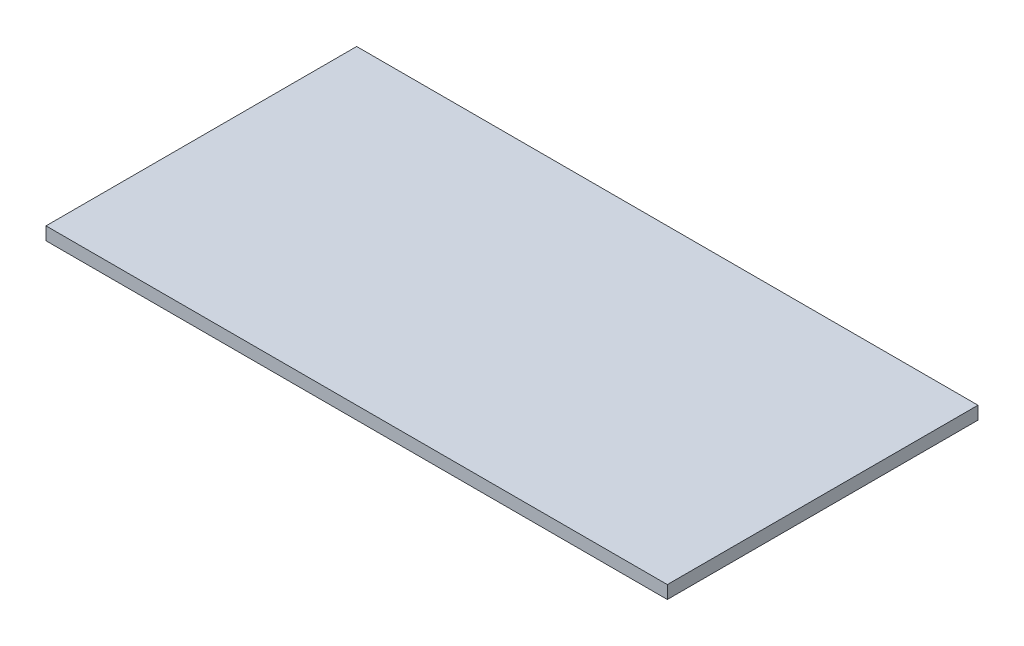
ISO-10303-21;
HEADER;
FILE_DESCRIPTION(('STEP AP214'),'2;1');
FILE_NAME('part.step','',(''),(''),'','','');
FILE_SCHEMA(('AUTOMOTIVE_DESIGN { 1 0 10303 214 1 1 1 1 }'));
ENDSEC;
DATA;
#1=APPLICATION_CONTEXT('core data for automotive mechanical design processes');
#2=APPLICATION_PROTOCOL_DEFINITION('international standard','automotive_design',2000,#1);
#3=PRODUCT_CONTEXT('',#1,'mechanical');
#4=PRODUCT('Part','Part','',(#3));
#5=PRODUCT_RELATED_PRODUCT_CATEGORY('part','',(#4));
#6=PRODUCT_DEFINITION_FORMATION('','',#4);
#7=PRODUCT_DEFINITION_CONTEXT('part definition',#1,'design');
#8=PRODUCT_DEFINITION('design','',#6,#7);
#9=PRODUCT_DEFINITION_SHAPE('','',#8);
#10=(LENGTH_UNIT() NAMED_UNIT(*) SI_UNIT(.MILLI.,.METRE.));
#11=(NAMED_UNIT(*) PLANE_ANGLE_UNIT() SI_UNIT($,.RADIAN.));
#12=(NAMED_UNIT(*) SI_UNIT($,.STERADIAN.) SOLID_ANGLE_UNIT());
#13=UNCERTAINTY_MEASURE_WITH_UNIT(LENGTH_MEASURE(1.E-05),#10,'distance_accuracy_value','');
#14=(GEOMETRIC_REPRESENTATION_CONTEXT(3) GLOBAL_UNCERTAINTY_ASSIGNED_CONTEXT((#13)) GLOBAL_UNIT_ASSIGNED_CONTEXT((#10,
#11,#12)) REPRESENTATION_CONTEXT('',''));
#15=CARTESIAN_POINT('',(0.,0.,0.));
#16=DIRECTION('',(0.,0.,1.));
#17=DIRECTION('',(1.,0.,0.));
#18=AXIS2_PLACEMENT_3D('',#15,#16,#17);
#19=CARTESIAN_POINT('',(-1200.,50.,-700.));
#20=DIRECTION('',(1.,0.,0.));
#21=DIRECTION('',(0.,0.,-1.));
#22=AXIS2_PLACEMENT_3D('',#19,#20,#21);
#23=PLANE('',#22);
#24=DIRECTION('',(0.,0.,1.));
#25=VECTOR('',#24,1.);
#26=CARTESIAN_POINT('',(-1200.,0.,-700.));
#27=LINE('',#26,#25);
#28=CARTESIAN_POINT('',(-1200.,0.,-700.));
#29=VERTEX_POINT('',#28);
#30=CARTESIAN_POINT('',(-1200.,0.,500.));
#31=VERTEX_POINT('',#30);
#32=EDGE_CURVE('E94',#29,#31,#27,.T.);
#33=ORIENTED_EDGE('',*,*,#32,.T.);
#34=DIRECTION('',(0.,-1.,0.));
#35=VECTOR('',#34,1.);
#36=CARTESIAN_POINT('',(-1200.,50.,500.));
#37=LINE('',#36,#35);
#38=CARTESIAN_POINT('',(-1200.,50.,500.));
#39=VERTEX_POINT('',#38);
#40=EDGE_CURVE('E11',#39,#31,#37,.T.);
#41=ORIENTED_EDGE('',*,*,#40,.F.);
#42=DIRECTION('',(0.,0.,1.));
#43=VECTOR('',#42,1.);
#44=CARTESIAN_POINT('',(-1200.,50.,-700.));
#45=LINE('',#44,#43);
#46=CARTESIAN_POINT('',(-1200.,50.,-700.));
#47=VERTEX_POINT('',#46);
#48=EDGE_CURVE('E82',#47,#39,#45,.T.);
#49=ORIENTED_EDGE('',*,*,#48,.F.);
#50=DIRECTION('',(0.,-1.,0.));
#51=VECTOR('',#50,1.);
#52=CARTESIAN_POINT('',(-1200.,50.,-700.));
#53=LINE('',#52,#51);
#54=EDGE_CURVE('E90',#47,#29,#53,.T.);
#55=ORIENTED_EDGE('',*,*,#54,.T.);
#56=EDGE_LOOP('',(#33,#41,#49,#55));
#57=FACE_BOUND('',#56,.T.);
#58=ADVANCED_FACE('F31',(#57),#23,.F.);
#59=CARTESIAN_POINT('',(-1200.,50.,500.));
#60=DIRECTION('',(0.,0.,-1.));
#61=DIRECTION('',(-1.,0.,0.));
#62=AXIS2_PLACEMENT_3D('',#59,#60,#61);
#63=PLANE('',#62);
#64=DIRECTION('',(1.,0.,0.));
#65=VECTOR('',#64,1.);
#66=CARTESIAN_POINT('',(-1200.,0.,500.));
#67=LINE('',#66,#65);
#68=CARTESIAN_POINT('',(1200.,0.,500.));
#69=VERTEX_POINT('',#68);
#70=EDGE_CURVE('E86',#31,#69,#67,.T.);
#71=ORIENTED_EDGE('',*,*,#70,.T.);
#72=DIRECTION('',(0.,-1.,0.));
#73=VECTOR('',#72,1.);
#74=CARTESIAN_POINT('',(1200.,50.,500.));
#75=LINE('',#74,#73);
#76=CARTESIAN_POINT('',(1200.,50.,500.));
#77=VERTEX_POINT('',#76);
#78=EDGE_CURVE('E39',#77,#69,#75,.T.);
#79=ORIENTED_EDGE('',*,*,#78,.F.);
#80=DIRECTION('',(1.,0.,0.));
#81=VECTOR('',#80,1.);
#82=CARTESIAN_POINT('',(-1200.,50.,500.));
#83=LINE('',#82,#81);
#84=EDGE_CURVE('E77',#39,#77,#83,.T.);
#85=ORIENTED_EDGE('',*,*,#84,.F.);
#86=ORIENTED_EDGE('',*,*,#40,.T.);
#87=EDGE_LOOP('',(#71,#79,#85,#86));
#88=FACE_BOUND('',#87,.T.);
#89=ADVANCED_FACE('F85',(#88),#63,.F.);
#90=CARTESIAN_POINT('',(1200.,50.,-700.));
#91=DIRECTION('',(-1.,0.,0.));
#92=DIRECTION('',(0.,0.,1.));
#93=AXIS2_PLACEMENT_3D('',#90,#91,#92);
#94=PLANE('',#93);
#95=DIRECTION('',(0.,0.,-1.));
#96=VECTOR('',#95,1.);
#97=CARTESIAN_POINT('',(1200.,0.,-700.));
#98=LINE('',#97,#96);
#99=CARTESIAN_POINT('',(1200.,0.,-700.));
#100=VERTEX_POINT('',#99);
#101=EDGE_CURVE('E64',#69,#100,#98,.T.);
#102=ORIENTED_EDGE('',*,*,#101,.T.);
#103=DIRECTION('',(0.,-1.,0.));
#104=VECTOR('',#103,1.);
#105=CARTESIAN_POINT('',(1200.,50.,-700.));
#106=LINE('',#105,#104);
#107=CARTESIAN_POINT('',(1200.,50.,-700.));
#108=VERTEX_POINT('',#107);
#109=EDGE_CURVE('E87',#108,#100,#106,.T.);
#110=ORIENTED_EDGE('',*,*,#109,.F.);
#111=DIRECTION('',(0.,0.,-1.));
#112=VECTOR('',#111,1.);
#113=CARTESIAN_POINT('',(1200.,50.,-700.));
#114=LINE('',#113,#112);
#115=EDGE_CURVE('E80',#77,#108,#114,.T.);
#116=ORIENTED_EDGE('',*,*,#115,.F.);
#117=ORIENTED_EDGE('',*,*,#78,.T.);
#118=EDGE_LOOP('',(#102,#110,#116,#117));
#119=FACE_BOUND('',#118,.T.);
#120=ADVANCED_FACE('F88',(#119),#94,.F.);
#121=CARTESIAN_POINT('',(-1200.,50.,-700.));
#122=DIRECTION('',(0.,0.,1.));
#123=DIRECTION('',(1.,0.,0.));
#124=AXIS2_PLACEMENT_3D('',#121,#122,#123);
#125=PLANE('',#124);
#126=DIRECTION('',(-1.,0.,0.));
#127=VECTOR('',#126,1.);
#128=CARTESIAN_POINT('',(-1200.,0.,-700.));
#129=LINE('',#128,#127);
#130=EDGE_CURVE('E70',#100,#29,#129,.T.);
#131=ORIENTED_EDGE('',*,*,#130,.T.);
#132=ORIENTED_EDGE('',*,*,#54,.F.);
#133=DIRECTION('',(-1.,0.,0.));
#134=VECTOR('',#133,1.);
#135=CARTESIAN_POINT('',(-1200.,50.,-700.));
#136=LINE('',#135,#134);
#137=EDGE_CURVE('E47',#108,#47,#136,.T.);
#138=ORIENTED_EDGE('',*,*,#137,.F.);
#139=ORIENTED_EDGE('',*,*,#109,.T.);
#140=EDGE_LOOP('',(#131,#132,#138,#139));
#141=FACE_BOUND('',#140,.T.);
#142=ADVANCED_FACE('F101',(#141),#125,.F.);
#143=CARTESIAN_POINT('',(-1200.,50.,500.));
#144=DIRECTION('',(0.,1.,0.));
#145=DIRECTION('',(0.,0.,1.));
#146=AXIS2_PLACEMENT_3D('',#143,#144,#145);
#147=PLANE('',#146);
#148=ORIENTED_EDGE('',*,*,#48,.T.);
#149=ORIENTED_EDGE('',*,*,#84,.T.);
#150=ORIENTED_EDGE('',*,*,#115,.T.);
#151=ORIENTED_EDGE('',*,*,#137,.T.);
#152=EDGE_LOOP('',(#148,#149,#150,#151));
#153=FACE_BOUND('',#152,.T.);
#154=ADVANCED_FACE('F78',(#153),#147,.T.);
#155=CARTESIAN_POINT('',(-1200.,0.,500.));
#156=DIRECTION('',(0.,1.,0.));
#157=DIRECTION('',(0.,0.,1.));
#158=AXIS2_PLACEMENT_3D('',#155,#156,#157);
#159=PLANE('',#158);
#160=ORIENTED_EDGE('',*,*,#32,.F.);
#161=ORIENTED_EDGE('',*,*,#130,.F.);
#162=ORIENTED_EDGE('',*,*,#101,.F.);
#163=ORIENTED_EDGE('',*,*,#70,.F.);
#164=EDGE_LOOP('',(#160,#161,#162,#163));
#165=FACE_BOUND('',#164,.T.);
#166=ADVANCED_FACE('F104',(#165),#159,.F.);
#167=CLOSED_SHELL('',(#58,#89,#120,#142,#154,#166));
#168=MANIFOLD_SOLID_BREP('B2',#167);
#169=ADVANCED_BREP_SHAPE_REPRESENTATION('',(#18,#168),#14);
#170=SHAPE_DEFINITION_REPRESENTATION(#9,#169);
ENDSEC;
END-ISO-10303-21;
